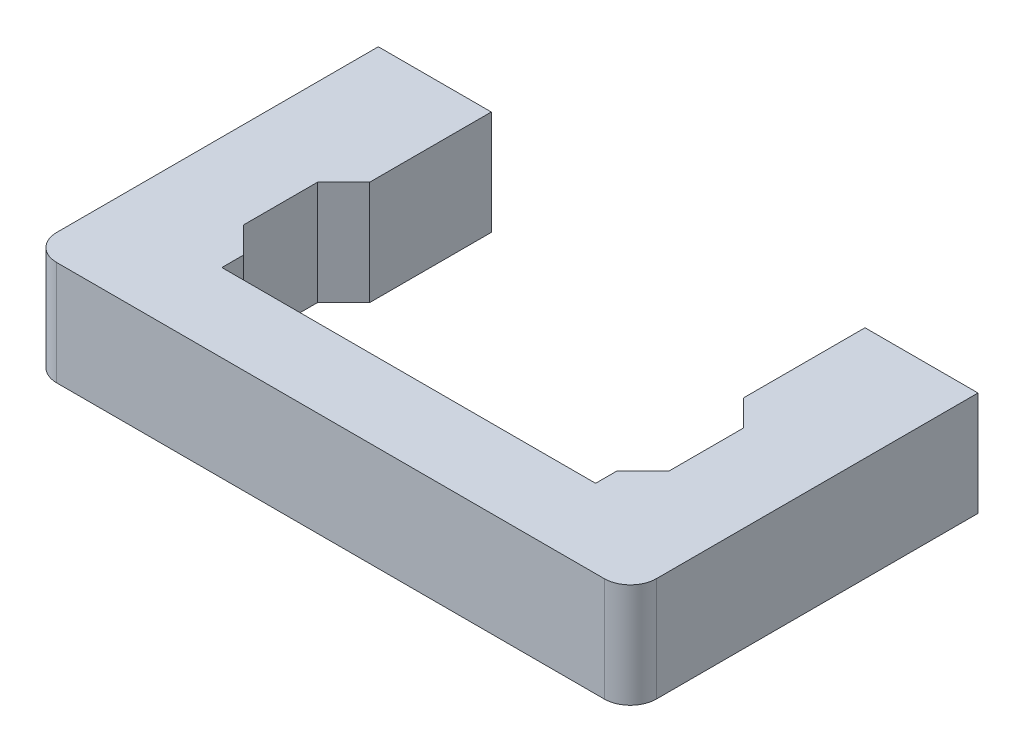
ISO-10303-21;
HEADER;
FILE_DESCRIPTION(('STEP AP214'),'2;1');
FILE_NAME('part.step','',(''),(''),'','','');
FILE_SCHEMA(('AUTOMOTIVE_DESIGN { 1 0 10303 214 1 1 1 1 }'));
ENDSEC;
DATA;
#1=APPLICATION_CONTEXT('core data for automotive mechanical design processes');
#2=APPLICATION_PROTOCOL_DEFINITION('international standard','automotive_design',2000,#1);
#3=PRODUCT_CONTEXT('',#1,'mechanical');
#4=PRODUCT('Part','Part','',(#3));
#5=PRODUCT_RELATED_PRODUCT_CATEGORY('part','',(#4));
#6=PRODUCT_DEFINITION_FORMATION('','',#4);
#7=PRODUCT_DEFINITION_CONTEXT('part definition',#1,'design');
#8=PRODUCT_DEFINITION('design','',#6,#7);
#9=PRODUCT_DEFINITION_SHAPE('','',#8);
#10=(LENGTH_UNIT() NAMED_UNIT(*) SI_UNIT(.MILLI.,.METRE.));
#11=(NAMED_UNIT(*) PLANE_ANGLE_UNIT() SI_UNIT($,.RADIAN.));
#12=(NAMED_UNIT(*) SI_UNIT($,.STERADIAN.) SOLID_ANGLE_UNIT());
#13=UNCERTAINTY_MEASURE_WITH_UNIT(LENGTH_MEASURE(1.E-05),#10,'distance_accuracy_value','');
#14=(GEOMETRIC_REPRESENTATION_CONTEXT(3) GLOBAL_UNCERTAINTY_ASSIGNED_CONTEXT((#13)) GLOBAL_UNIT_ASSIGNED_CONTEXT((#10,
#11,#12)) REPRESENTATION_CONTEXT('',''));
#15=CARTESIAN_POINT('',(0.,0.,0.));
#16=DIRECTION('',(0.,0.,1.));
#17=DIRECTION('',(1.,0.,0.));
#18=AXIS2_PLACEMENT_3D('',#15,#16,#17);
#19=CARTESIAN_POINT('',(27.5,-6.,40.));
#20=DIRECTION('',(0.,0.,-1.));
#21=DIRECTION('',(0.,1.,0.));
#22=AXIS2_PLACEMENT_3D('',#19,#20,#21);
#23=PLANE('',#22);
#24=DIRECTION('',(0.,1.,0.));
#25=VECTOR('',#24,1.);
#26=CARTESIAN_POINT('',(-4.,-6.,40.));
#27=LINE('',#26,#25);
#28=CARTESIAN_POINT('',(-4.,-6.,40.));
#29=VERTEX_POINT('',#28);
#30=CARTESIAN_POINT('',(-4.,6.,40.));
#31=VERTEX_POINT('',#30);
#32=EDGE_CURVE('E9',#29,#31,#27,.T.);
#33=ORIENTED_EDGE('',*,*,#32,.F.);
#34=DIRECTION('',(-1.,0.,0.));
#35=VECTOR('',#34,1.);
#36=CARTESIAN_POINT('',(27.5,-6.,40.));
#37=LINE('',#36,#35);
#38=CARTESIAN_POINT('',(59.,-6.,40.));
#39=VERTEX_POINT('',#38);
#40=EDGE_CURVE('E157',#39,#29,#37,.T.);
#41=ORIENTED_EDGE('',*,*,#40,.F.);
#42=DIRECTION('',(0.,1.,0.));
#43=VECTOR('',#42,1.);
#44=CARTESIAN_POINT('',(59.,-6.,40.));
#45=LINE('',#44,#43);
#46=CARTESIAN_POINT('',(59.,6.,40.));
#47=VERTEX_POINT('',#46);
#48=EDGE_CURVE('E155',#39,#47,#45,.T.);
#49=ORIENTED_EDGE('',*,*,#48,.T.);
#50=DIRECTION('',(-1.,0.,0.));
#51=VECTOR('',#50,1.);
#52=CARTESIAN_POINT('',(27.5,6.,40.));
#53=LINE('',#52,#51);
#54=EDGE_CURVE('E141',#47,#31,#53,.T.);
#55=ORIENTED_EDGE('',*,*,#54,.T.);
#56=EDGE_LOOP('',(#33,#41,#49,#55));
#57=FACE_BOUND('',#56,.T.);
#58=ADVANCED_FACE('F14',(#57),#23,.F.);
#59=CARTESIAN_POINT('',(-4.,-6.,37.));
#60=DIRECTION('',(0.,1.,0.));
#61=DIRECTION('',(-1.,0.,0.));
#62=AXIS2_PLACEMENT_3D('',#59,#60,#61);
#63=CYLINDRICAL_SURFACE('',#62,3.);
#64=DIRECTION('',(0.,1.,0.));
#65=VECTOR('',#64,1.);
#66=CARTESIAN_POINT('',(-7.,-6.,37.));
#67=LINE('',#66,#65);
#68=CARTESIAN_POINT('',(-7.,-6.,37.));
#69=VERTEX_POINT('',#68);
#70=CARTESIAN_POINT('',(-7.,6.,37.));
#71=VERTEX_POINT('',#70);
#72=EDGE_CURVE('E22',#69,#71,#67,.T.);
#73=ORIENTED_EDGE('',*,*,#72,.F.);
#74=CARTESIAN_POINT('',(-4.,-6.,37.));
#75=DIRECTION('',(0.,-1.,0.));
#76=DIRECTION('',(1.,0.,0.));
#77=AXIS2_PLACEMENT_3D('',#74,#75,#76);
#78=CIRCLE('',#77,3.);
#79=EDGE_CURVE('E260',#29,#69,#78,.T.);
#80=ORIENTED_EDGE('',*,*,#79,.F.);
#81=ORIENTED_EDGE('',*,*,#32,.T.);
#82=CARTESIAN_POINT('',(-4.,6.,37.));
#83=DIRECTION('',(0.,-1.,0.));
#84=DIRECTION('',(1.,0.,0.));
#85=AXIS2_PLACEMENT_3D('',#82,#83,#84);
#86=CIRCLE('',#85,3.);
#87=EDGE_CURVE('E150',#31,#71,#86,.T.);
#88=ORIENTED_EDGE('',*,*,#87,.T.);
#89=EDGE_LOOP('',(#73,#80,#81,#88));
#90=FACE_BOUND('',#89,.T.);
#91=ADVANCED_FACE('F16',(#90),#63,.T.);
#92=CARTESIAN_POINT('',(-7.,-6.,37.));
#93=DIRECTION('',(1.,0.,0.));
#94=DIRECTION('',(0.,1.,0.));
#95=AXIS2_PLACEMENT_3D('',#92,#93,#94);
#96=PLANE('',#95);
#97=DIRECTION('',(0.,1.,0.));
#98=VECTOR('',#97,1.);
#99=CARTESIAN_POINT('',(-7.,-6.,0.));
#100=LINE('',#99,#98);
#101=CARTESIAN_POINT('',(-7.,-6.,0.));
#102=VERTEX_POINT('',#101);
#103=CARTESIAN_POINT('',(-7.,6.,0.));
#104=VERTEX_POINT('',#103);
#105=EDGE_CURVE('E295',#102,#104,#100,.T.);
#106=ORIENTED_EDGE('',*,*,#105,.F.);
#107=DIRECTION('',(0.,0.,-1.));
#108=VECTOR('',#107,1.);
#109=CARTESIAN_POINT('',(-7.,-6.,37.));
#110=LINE('',#109,#108);
#111=EDGE_CURVE('E263',#69,#102,#110,.T.);
#112=ORIENTED_EDGE('',*,*,#111,.F.);
#113=ORIENTED_EDGE('',*,*,#72,.T.);
#114=DIRECTION('',(0.,0.,-1.));
#115=VECTOR('',#114,1.);
#116=CARTESIAN_POINT('',(-7.,6.,37.));
#117=LINE('',#116,#115);
#118=EDGE_CURVE('E236',#71,#104,#117,.T.);
#119=ORIENTED_EDGE('',*,*,#118,.T.);
#120=EDGE_LOOP('',(#106,#112,#113,#119));
#121=FACE_BOUND('',#120,.T.);
#122=ADVANCED_FACE('F298',(#121),#96,.F.);
#123=CARTESIAN_POINT('',(-7.,-6.,0.));
#124=DIRECTION('',(0.,0.,1.));
#125=DIRECTION('',(0.,-1.,0.));
#126=AXIS2_PLACEMENT_3D('',#123,#124,#125);
#127=PLANE('',#126);
#128=CARTESIAN_POINT('',(0.,0.,0.));
#129=DIRECTION('',(0.,0.,-1.));
#130=DIRECTION('',(0.,1.,0.));
#131=AXIS2_PLACEMENT_3D('',#128,#129,#130);
#132=CIRCLE('',#131,2.5);
#133=CARTESIAN_POINT('',(0.,2.5,0.));
#134=VERTEX_POINT('',#133);
#135=EDGE_CURVE('E161',#134,#134,#132,.T.);
#136=ORIENTED_EDGE('',*,*,#135,.F.);
#137=EDGE_LOOP('',(#136));
#138=FACE_BOUND('',#137,.T.);
#139=DIRECTION('',(0.,1.,0.));
#140=VECTOR('',#139,1.);
#141=CARTESIAN_POINT('',(6.,-6.,0.));
#142=LINE('',#141,#140);
#143=CARTESIAN_POINT('',(6.,-6.,0.));
#144=VERTEX_POINT('',#143);
#145=CARTESIAN_POINT('',(6.,6.,0.));
#146=VERTEX_POINT('',#145);
#147=EDGE_CURVE('E293',#144,#146,#142,.T.);
#148=ORIENTED_EDGE('',*,*,#147,.F.);
#149=DIRECTION('',(1.,0.,0.));
#150=VECTOR('',#149,1.);
#151=CARTESIAN_POINT('',(-7.,-6.,0.));
#152=LINE('',#151,#150);
#153=EDGE_CURVE('E266',#102,#144,#152,.T.);
#154=ORIENTED_EDGE('',*,*,#153,.F.);
#155=ORIENTED_EDGE('',*,*,#105,.T.);
#156=DIRECTION('',(1.,0.,0.));
#157=VECTOR('',#156,1.);
#158=CARTESIAN_POINT('',(-7.,6.,0.));
#159=LINE('',#158,#157);
#160=EDGE_CURVE('E239',#104,#146,#159,.T.);
#161=ORIENTED_EDGE('',*,*,#160,.T.);
#162=EDGE_LOOP('',(#148,#154,#155,#161));
#163=FACE_BOUND('',#162,.T.);
#164=ADVANCED_FACE('F305',(#138,#163),#127,.F.);
#165=CARTESIAN_POINT('',(6.,-6.,0.));
#166=DIRECTION('',(-1.,0.,0.));
#167=DIRECTION('',(0.,0.,-1.));
#168=AXIS2_PLACEMENT_3D('',#165,#166,#167);
#169=PLANE('',#168);
#170=DIRECTION('',(0.,1.,0.));
#171=VECTOR('',#170,1.);
#172=CARTESIAN_POINT('',(6.,-6.,14.));
#173=LINE('',#172,#171);
#174=CARTESIAN_POINT('',(6.,-6.,14.));
#175=VERTEX_POINT('',#174);
#176=CARTESIAN_POINT('',(6.,6.,14.));
#177=VERTEX_POINT('',#176);
#178=EDGE_CURVE('E291',#175,#177,#173,.T.);
#179=ORIENTED_EDGE('',*,*,#178,.F.);
#180=DIRECTION('',(0.,0.,1.));
#181=VECTOR('',#180,1.);
#182=CARTESIAN_POINT('',(6.,-6.,0.));
#183=LINE('',#182,#181);
#184=EDGE_CURVE('E269',#144,#175,#183,.T.);
#185=ORIENTED_EDGE('',*,*,#184,.F.);
#186=ORIENTED_EDGE('',*,*,#147,.T.);
#187=DIRECTION('',(0.,0.,1.));
#188=VECTOR('',#187,1.);
#189=CARTESIAN_POINT('',(6.,6.,0.));
#190=LINE('',#189,#188);
#191=EDGE_CURVE('E242',#146,#177,#190,.T.);
#192=ORIENTED_EDGE('',*,*,#191,.T.);
#193=EDGE_LOOP('',(#179,#185,#186,#192));
#194=FACE_BOUND('',#193,.T.);
#195=ADVANCED_FACE('F351',(#194),#169,.F.);
#196=CARTESIAN_POINT('',(6.,-6.,14.));
#197=DIRECTION('',(-0.707106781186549,0.,-0.707106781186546));
#198=DIRECTION('',(0.707106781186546,0.,-0.707106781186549));
#199=AXIS2_PLACEMENT_3D('',#196,#197,#198);
#200=PLANE('',#199);
#201=DIRECTION('',(0.,1.,0.));
#202=VECTOR('',#201,1.);
#203=CARTESIAN_POINT('',(3.,-6.,17.));
#204=LINE('',#203,#202);
#205=CARTESIAN_POINT('',(3.,-6.,17.));
#206=VERTEX_POINT('',#205);
#207=CARTESIAN_POINT('',(3.,6.,17.));
#208=VERTEX_POINT('',#207);
#209=EDGE_CURVE('E289',#206,#208,#204,.T.);
#210=ORIENTED_EDGE('',*,*,#209,.F.);
#211=DIRECTION('',(-0.707106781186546,0.,0.707106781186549));
#212=VECTOR('',#211,1.);
#213=CARTESIAN_POINT('',(6.,-6.,14.));
#214=LINE('',#213,#212);
#215=EDGE_CURVE('E272',#175,#206,#214,.T.);
#216=ORIENTED_EDGE('',*,*,#215,.F.);
#217=ORIENTED_EDGE('',*,*,#178,.T.);
#218=DIRECTION('',(-0.707106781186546,0.,0.707106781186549));
#219=VECTOR('',#218,1.);
#220=CARTESIAN_POINT('',(6.,6.,14.));
#221=LINE('',#220,#219);
#222=EDGE_CURVE('E245',#177,#208,#221,.T.);
#223=ORIENTED_EDGE('',*,*,#222,.T.);
#224=EDGE_LOOP('',(#210,#216,#217,#223));
#225=FACE_BOUND('',#224,.T.);
#226=ADVANCED_FACE('F349',(#225),#200,.F.);
#227=CARTESIAN_POINT('',(3.,-6.,25.5));
#228=DIRECTION('',(1.,0.,0.));
#229=DIRECTION('',(0.,0.,1.));
#230=AXIS2_PLACEMENT_3D('',#227,#228,#229);
#231=PLANE('',#230);
#232=DIRECTION('',(0.,1.,0.));
#233=VECTOR('',#232,1.);
#234=CARTESIAN_POINT('',(3.,-6.,25.5));
#235=LINE('',#234,#233);
#236=CARTESIAN_POINT('',(3.,-6.,25.5));
#237=VERTEX_POINT('',#236);
#238=CARTESIAN_POINT('',(3.,6.,25.5));
#239=VERTEX_POINT('',#238);
#240=EDGE_CURVE('E287',#237,#239,#235,.T.);
#241=ORIENTED_EDGE('',*,*,#240,.F.);
#242=DIRECTION('',(0.,0.,-1.));
#243=VECTOR('',#242,1.);
#244=CARTESIAN_POINT('',(3.,-6.,25.5));
#245=LINE('',#244,#243);
#246=EDGE_CURVE('E275',#237,#206,#245,.T.);
#247=ORIENTED_EDGE('',*,*,#246,.T.);
#248=ORIENTED_EDGE('',*,*,#209,.T.);
#249=DIRECTION('',(0.,0.,-1.));
#250=VECTOR('',#249,1.);
#251=CARTESIAN_POINT('',(3.,6.,25.5));
#252=LINE('',#251,#250);
#253=EDGE_CURVE('E248',#239,#208,#252,.T.);
#254=ORIENTED_EDGE('',*,*,#253,.F.);
#255=EDGE_LOOP('',(#241,#247,#248,#254));
#256=FACE_BOUND('',#255,.T.);
#257=ADVANCED_FACE('F345',(#256),#231,.T.);
#258=CARTESIAN_POINT('',(6.,-6.,28.5));
#259=DIRECTION('',(0.707106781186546,0.,-0.707106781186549));
#260=DIRECTION('',(0.707106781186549,0.,0.707106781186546));
#261=AXIS2_PLACEMENT_3D('',#258,#259,#260);
#262=PLANE('',#261);
#263=DIRECTION('',(0.,1.,0.));
#264=VECTOR('',#263,1.);
#265=CARTESIAN_POINT('',(6.,-6.,28.5));
#266=LINE('',#265,#264);
#267=CARTESIAN_POINT('',(6.,-6.,28.5));
#268=VERTEX_POINT('',#267);
#269=CARTESIAN_POINT('',(6.,6.,28.5));
#270=VERTEX_POINT('',#269);
#271=EDGE_CURVE('E37',#268,#270,#266,.T.);
#272=ORIENTED_EDGE('',*,*,#271,.F.);
#273=DIRECTION('',(-0.707106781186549,0.,-0.707106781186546));
#274=VECTOR('',#273,1.);
#275=CARTESIAN_POINT('',(6.,-6.,28.5));
#276=LINE('',#275,#274);
#277=EDGE_CURVE('E278',#268,#237,#276,.T.);
#278=ORIENTED_EDGE('',*,*,#277,.T.);
#279=ORIENTED_EDGE('',*,*,#240,.T.);
#280=DIRECTION('',(-0.707106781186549,0.,-0.707106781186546));
#281=VECTOR('',#280,1.);
#282=CARTESIAN_POINT('',(6.,6.,28.5));
#283=LINE('',#282,#281);
#284=EDGE_CURVE('E251',#270,#239,#283,.T.);
#285=ORIENTED_EDGE('',*,*,#284,.F.);
#286=EDGE_LOOP('',(#272,#278,#279,#285));
#287=FACE_BOUND('',#286,.T.);
#288=ADVANCED_FACE('F342',(#287),#262,.T.);
#289=CARTESIAN_POINT('',(6.,-6.,28.5));
#290=DIRECTION('',(-1.,0.,0.));
#291=DIRECTION('',(0.,0.,-1.));
#292=AXIS2_PLACEMENT_3D('',#289,#290,#291);
#293=PLANE('',#292);
#294=DIRECTION('',(0.,1.,0.));
#295=VECTOR('',#294,1.);
#296=CARTESIAN_POINT('',(6.,-6.,31.));
#297=LINE('',#296,#295);
#298=CARTESIAN_POINT('',(6.,-6.,31.));
#299=VERTEX_POINT('',#298);
#300=CARTESIAN_POINT('',(6.,6.,31.));
#301=VERTEX_POINT('',#300);
#302=EDGE_CURVE('E29',#299,#301,#297,.T.);
#303=ORIENTED_EDGE('',*,*,#302,.F.);
#304=DIRECTION('',(0.,0.,1.));
#305=VECTOR('',#304,1.);
#306=CARTESIAN_POINT('',(6.,-6.,28.5));
#307=LINE('',#306,#305);
#308=EDGE_CURVE('E280',#268,#299,#307,.T.);
#309=ORIENTED_EDGE('',*,*,#308,.F.);
#310=ORIENTED_EDGE('',*,*,#271,.T.);
#311=DIRECTION('',(0.,0.,1.));
#312=VECTOR('',#311,1.);
#313=CARTESIAN_POINT('',(6.,6.,28.5));
#314=LINE('',#313,#312);
#315=EDGE_CURVE('E254',#270,#301,#314,.T.);
#316=ORIENTED_EDGE('',*,*,#315,.T.);
#317=EDGE_LOOP('',(#303,#309,#310,#316));
#318=FACE_BOUND('',#317,.T.);
#319=ADVANCED_FACE('F341',(#318),#293,.F.);
#320=CARTESIAN_POINT('',(27.5,-6.,31.));
#321=DIRECTION('',(0.,0.,-1.));
#322=DIRECTION('',(0.,1.,0.));
#323=AXIS2_PLACEMENT_3D('',#320,#321,#322);
#324=PLANE('',#323);
#325=DIRECTION('',(-1.,0.,0.));
#326=VECTOR('',#325,1.);
#327=CARTESIAN_POINT('',(27.5,6.,31.));
#328=LINE('',#327,#326);
#329=CARTESIAN_POINT('',(49.,6.,31.));
#330=VERTEX_POINT('',#329);
#331=EDGE_CURVE('E256',#330,#301,#328,.T.);
#332=ORIENTED_EDGE('',*,*,#331,.F.);
#333=DIRECTION('',(0.,1.,0.));
#334=VECTOR('',#333,1.);
#335=CARTESIAN_POINT('',(49.,-6.,31.));
#336=LINE('',#335,#334);
#337=CARTESIAN_POINT('',(49.,-6.,31.));
#338=VERTEX_POINT('',#337);
#339=EDGE_CURVE('E215',#338,#330,#336,.T.);
#340=ORIENTED_EDGE('',*,*,#339,.F.);
#341=DIRECTION('',(-1.,0.,0.));
#342=VECTOR('',#341,1.);
#343=CARTESIAN_POINT('',(27.5,-6.,31.));
#344=LINE('',#343,#342);
#345=EDGE_CURVE('E282',#338,#299,#344,.T.);
#346=ORIENTED_EDGE('',*,*,#345,.T.);
#347=ORIENTED_EDGE('',*,*,#302,.T.);
#348=EDGE_LOOP('',(#332,#340,#346,#347));
#349=FACE_BOUND('',#348,.T.);
#350=ADVANCED_FACE('F340',(#349),#324,.T.);
#351=CARTESIAN_POINT('',(-4.,-6.,37.));
#352=DIRECTION('',(0.,-1.,0.));
#353=DIRECTION('',(1.,0.,0.));
#354=AXIS2_PLACEMENT_3D('',#351,#352,#353);
#355=PLANE('',#354);
#356=ORIENTED_EDGE('',*,*,#40,.T.);
#357=ORIENTED_EDGE('',*,*,#79,.T.);
#358=ORIENTED_EDGE('',*,*,#111,.T.);
#359=ORIENTED_EDGE('',*,*,#153,.T.);
#360=ORIENTED_EDGE('',*,*,#184,.T.);
#361=ORIENTED_EDGE('',*,*,#215,.T.);
#362=ORIENTED_EDGE('',*,*,#246,.F.);
#363=ORIENTED_EDGE('',*,*,#277,.F.);
#364=ORIENTED_EDGE('',*,*,#308,.T.);
#365=ORIENTED_EDGE('',*,*,#345,.F.);
#366=DIRECTION('',(0.,0.,1.));
#367=VECTOR('',#366,1.);
#368=CARTESIAN_POINT('',(49.,-6.,28.5));
#369=LINE('',#368,#367);
#370=CARTESIAN_POINT('',(49.,-6.,28.5));
#371=VERTEX_POINT('',#370);
#372=EDGE_CURVE('E212',#371,#338,#369,.T.);
#373=ORIENTED_EDGE('',*,*,#372,.F.);
#374=DIRECTION('',(0.707106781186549,0.,-0.707106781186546));
#375=VECTOR('',#374,1.);
#376=CARTESIAN_POINT('',(49.,-6.,28.5));
#377=LINE('',#376,#375);
#378=CARTESIAN_POINT('',(52.,-6.,25.5));
#379=VERTEX_POINT('',#378);
#380=EDGE_CURVE('E209',#371,#379,#377,.T.);
#381=ORIENTED_EDGE('',*,*,#380,.T.);
#382=DIRECTION('',(0.,0.,-1.));
#383=VECTOR('',#382,1.);
#384=CARTESIAN_POINT('',(52.,-6.,25.5));
#385=LINE('',#384,#383);
#386=CARTESIAN_POINT('',(52.,-6.,17.));
#387=VERTEX_POINT('',#386);
#388=EDGE_CURVE('E206',#379,#387,#385,.T.);
#389=ORIENTED_EDGE('',*,*,#388,.T.);
#390=DIRECTION('',(0.707106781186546,0.,0.707106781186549));
#391=VECTOR('',#390,1.);
#392=CARTESIAN_POINT('',(49.,-6.,14.));
#393=LINE('',#392,#391);
#394=CARTESIAN_POINT('',(49.,-6.,14.));
#395=VERTEX_POINT('',#394);
#396=EDGE_CURVE('E203',#395,#387,#393,.T.);
#397=ORIENTED_EDGE('',*,*,#396,.F.);
#398=DIRECTION('',(0.,0.,1.));
#399=VECTOR('',#398,1.);
#400=CARTESIAN_POINT('',(49.,-6.,0.));
#401=LINE('',#400,#399);
#402=CARTESIAN_POINT('',(49.,-6.,0.));
#403=VERTEX_POINT('',#402);
#404=EDGE_CURVE('E200',#403,#395,#401,.T.);
#405=ORIENTED_EDGE('',*,*,#404,.F.);
#406=DIRECTION('',(-1.,0.,0.));
#407=VECTOR('',#406,1.);
#408=CARTESIAN_POINT('',(62.,-6.,0.));
#409=LINE('',#408,#407);
#410=CARTESIAN_POINT('',(62.,-6.,0.));
#411=VERTEX_POINT('',#410);
#412=EDGE_CURVE('E197',#411,#403,#409,.T.);
#413=ORIENTED_EDGE('',*,*,#412,.F.);
#414=DIRECTION('',(0.,0.,-1.));
#415=VECTOR('',#414,1.);
#416=CARTESIAN_POINT('',(62.,-6.,37.));
#417=LINE('',#416,#415);
#418=CARTESIAN_POINT('',(62.,-6.,37.));
#419=VERTEX_POINT('',#418);
#420=EDGE_CURVE('E194',#419,#411,#417,.T.);
#421=ORIENTED_EDGE('',*,*,#420,.F.);
#422=CARTESIAN_POINT('',(59.,-6.,37.));
#423=DIRECTION('',(0.,1.,0.));
#424=DIRECTION('',(-1.,0.,0.));
#425=AXIS2_PLACEMENT_3D('',#422,#423,#424);
#426=CIRCLE('',#425,3.);
#427=EDGE_CURVE('E192',#39,#419,#426,.T.);
#428=ORIENTED_EDGE('',*,*,#427,.F.);
#429=EDGE_LOOP('',(#356,#357,#358,#359,#360,#361,#362,#363,#364,#365,#373,#381,#389,#397,#405,
#413,#421,#428));
#430=FACE_BOUND('',#429,.T.);
#431=ADVANCED_FACE('F308',(#430),#355,.T.);
#432=CARTESIAN_POINT('',(-4.,6.,37.));
#433=DIRECTION('',(0.,-1.,0.));
#434=DIRECTION('',(1.,0.,0.));
#435=AXIS2_PLACEMENT_3D('',#432,#433,#434);
#436=PLANE('',#435);
#437=ORIENTED_EDGE('',*,*,#54,.F.);
#438=CARTESIAN_POINT('',(59.,6.,37.));
#439=DIRECTION('',(0.,1.,0.));
#440=DIRECTION('',(-1.,0.,0.));
#441=AXIS2_PLACEMENT_3D('',#438,#439,#440);
#442=CIRCLE('',#441,3.);
#443=CARTESIAN_POINT('',(62.,6.,37.));
#444=VERTEX_POINT('',#443);
#445=EDGE_CURVE('E146',#47,#444,#442,.T.);
#446=ORIENTED_EDGE('',*,*,#445,.T.);
#447=DIRECTION('',(0.,0.,-1.));
#448=VECTOR('',#447,1.);
#449=CARTESIAN_POINT('',(62.,6.,37.));
#450=LINE('',#449,#448);
#451=CARTESIAN_POINT('',(62.,6.,0.));
#452=VERTEX_POINT('',#451);
#453=EDGE_CURVE('E165',#444,#452,#450,.T.);
#454=ORIENTED_EDGE('',*,*,#453,.T.);
#455=DIRECTION('',(-1.,0.,0.));
#456=VECTOR('',#455,1.);
#457=CARTESIAN_POINT('',(62.,6.,0.));
#458=LINE('',#457,#456);
#459=CARTESIAN_POINT('',(49.,6.,0.));
#460=VERTEX_POINT('',#459);
#461=EDGE_CURVE('E168',#452,#460,#458,.T.);
#462=ORIENTED_EDGE('',*,*,#461,.T.);
#463=DIRECTION('',(0.,0.,1.));
#464=VECTOR('',#463,1.);
#465=CARTESIAN_POINT('',(49.,6.,0.));
#466=LINE('',#465,#464);
#467=CARTESIAN_POINT('',(49.,6.,14.));
#468=VERTEX_POINT('',#467);
#469=EDGE_CURVE('E177',#460,#468,#466,.T.);
#470=ORIENTED_EDGE('',*,*,#469,.T.);
#471=DIRECTION('',(0.707106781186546,0.,0.707106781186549));
#472=VECTOR('',#471,1.);
#473=CARTESIAN_POINT('',(49.,6.,14.));
#474=LINE('',#473,#472);
#475=CARTESIAN_POINT('',(52.,6.,17.));
#476=VERTEX_POINT('',#475);
#477=EDGE_CURVE('E180',#468,#476,#474,.T.);
#478=ORIENTED_EDGE('',*,*,#477,.T.);
#479=DIRECTION('',(0.,0.,-1.));
#480=VECTOR('',#479,1.);
#481=CARTESIAN_POINT('',(52.,6.,25.5));
#482=LINE('',#481,#480);
#483=CARTESIAN_POINT('',(52.,6.,25.5));
#484=VERTEX_POINT('',#483);
#485=EDGE_CURVE('E183',#484,#476,#482,.T.);
#486=ORIENTED_EDGE('',*,*,#485,.F.);
#487=DIRECTION('',(0.707106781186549,0.,-0.707106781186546));
#488=VECTOR('',#487,1.);
#489=CARTESIAN_POINT('',(49.,6.,28.5));
#490=LINE('',#489,#488);
#491=CARTESIAN_POINT('',(49.,6.,28.5));
#492=VERTEX_POINT('',#491);
#493=EDGE_CURVE('E186',#492,#484,#490,.T.);
#494=ORIENTED_EDGE('',*,*,#493,.F.);
#495=DIRECTION('',(0.,0.,1.));
#496=VECTOR('',#495,1.);
#497=CARTESIAN_POINT('',(49.,6.,28.5));
#498=LINE('',#497,#496);
#499=EDGE_CURVE('E189',#492,#330,#498,.T.);
#500=ORIENTED_EDGE('',*,*,#499,.T.);
#501=ORIENTED_EDGE('',*,*,#331,.T.);
#502=ORIENTED_EDGE('',*,*,#315,.F.);
#503=ORIENTED_EDGE('',*,*,#284,.T.);
#504=ORIENTED_EDGE('',*,*,#253,.T.);
#505=ORIENTED_EDGE('',*,*,#222,.F.);
#506=ORIENTED_EDGE('',*,*,#191,.F.);
#507=ORIENTED_EDGE('',*,*,#160,.F.);
#508=ORIENTED_EDGE('',*,*,#118,.F.);
#509=ORIENTED_EDGE('',*,*,#87,.F.);
#510=EDGE_LOOP('',(#437,#446,#454,#462,#470,#478,#486,#494,#500,#501,#502,#503,#504,#505,#506,
#507,#508,#509));
#511=FACE_BOUND('',#510,.T.);
#512=ADVANCED_FACE('F143',(#511),#436,.F.);
#513=CARTESIAN_POINT('',(0.,0.,10.));
#514=DIRECTION('',(0.,0.,-1.));
#515=DIRECTION('',(0.,1.,0.));
#516=AXIS2_PLACEMENT_3D('',#513,#514,#515);
#517=CYLINDRICAL_SURFACE('',#516,2.5);
#518=CARTESIAN_POINT('',(0.,0.,10.));
#519=DIRECTION('',(0.,0.,-1.));
#520=DIRECTION('',(0.,1.,0.));
#521=AXIS2_PLACEMENT_3D('',#518,#519,#520);
#522=CIRCLE('',#521,2.5);
#523=CARTESIAN_POINT('',(0.,2.5,10.));
#524=VERTEX_POINT('',#523);
#525=EDGE_CURVE('E152',#524,#524,#522,.T.);
#526=ORIENTED_EDGE('',*,*,#525,.F.);
#527=EDGE_LOOP('',(#526));
#528=FACE_BOUND('',#527,.T.);
#529=ORIENTED_EDGE('',*,*,#135,.T.);
#530=EDGE_LOOP('',(#529));
#531=FACE_BOUND('',#530,.T.);
#532=ADVANCED_FACE('F417',(#528,#531),#517,.F.);
#533=CARTESIAN_POINT('',(0.,0.,10.));
#534=DIRECTION('',(0.,0.,-1.));
#535=DIRECTION('',(0.,1.,0.));
#536=AXIS2_PLACEMENT_3D('',#533,#534,#535);
#537=PLANE('',#536);
#538=ORIENTED_EDGE('',*,*,#525,.T.);
#539=EDGE_LOOP('',(#538));
#540=FACE_BOUND('',#539,.T.);
#541=ADVANCED_FACE('F418',(#540),#537,.T.);
#542=CARTESIAN_POINT('',(59.,-6.,37.));
#543=DIRECTION('',(0.,1.,0.));
#544=DIRECTION('',(1.,0.,0.));
#545=AXIS2_PLACEMENT_3D('',#542,#543,#544);
#546=CYLINDRICAL_SURFACE('',#545,3.);
#547=DIRECTION('',(0.,1.,0.));
#548=VECTOR('',#547,1.);
#549=CARTESIAN_POINT('',(62.,-6.,37.));
#550=LINE('',#549,#548);
#551=EDGE_CURVE('E162',#419,#444,#550,.T.);
#552=ORIENTED_EDGE('',*,*,#551,.T.);
#553=ORIENTED_EDGE('',*,*,#445,.F.);
#554=ORIENTED_EDGE('',*,*,#48,.F.);
#555=ORIENTED_EDGE('',*,*,#427,.T.);
#556=EDGE_LOOP('',(#552,#553,#554,#555));
#557=FACE_BOUND('',#556,.T.);
#558=ADVANCED_FACE('F164',(#557),#546,.T.);
#559=CARTESIAN_POINT('',(62.,-6.,37.));
#560=DIRECTION('',(-1.,0.,0.));
#561=DIRECTION('',(0.,1.,0.));
#562=AXIS2_PLACEMENT_3D('',#559,#560,#561);
#563=PLANE('',#562);
#564=DIRECTION('',(0.,1.,0.));
#565=VECTOR('',#564,1.);
#566=CARTESIAN_POINT('',(62.,-6.,0.));
#567=LINE('',#566,#565);
#568=EDGE_CURVE('E228',#411,#452,#567,.T.);
#569=ORIENTED_EDGE('',*,*,#568,.T.);
#570=ORIENTED_EDGE('',*,*,#453,.F.);
#571=ORIENTED_EDGE('',*,*,#551,.F.);
#572=ORIENTED_EDGE('',*,*,#420,.T.);
#573=EDGE_LOOP('',(#569,#570,#571,#572));
#574=FACE_BOUND('',#573,.T.);
#575=ADVANCED_FACE('F314',(#574),#563,.F.);
#576=CARTESIAN_POINT('',(62.,-6.,0.));
#577=DIRECTION('',(0.,0.,1.));
#578=DIRECTION('',(0.,-1.,0.));
#579=AXIS2_PLACEMENT_3D('',#576,#577,#578);
#580=PLANE('',#579);
#581=CARTESIAN_POINT('',(55.,0.,0.));
#582=DIRECTION('',(0.,0.,1.));
#583=DIRECTION('',(0.,1.,0.));
#584=AXIS2_PLACEMENT_3D('',#581,#582,#583);
#585=CIRCLE('',#584,2.5);
#586=CARTESIAN_POINT('',(55.,2.5,0.));
#587=VERTEX_POINT('',#586);
#588=EDGE_CURVE('E171',#587,#587,#585,.T.);
#589=ORIENTED_EDGE('',*,*,#588,.T.);
#590=EDGE_LOOP('',(#589));
#591=FACE_BOUND('',#590,.T.);
#592=DIRECTION('',(0.,1.,0.));
#593=VECTOR('',#592,1.);
#594=CARTESIAN_POINT('',(49.,-6.,0.));
#595=LINE('',#594,#593);
#596=EDGE_CURVE('E226',#403,#460,#595,.T.);
#597=ORIENTED_EDGE('',*,*,#596,.T.);
#598=ORIENTED_EDGE('',*,*,#461,.F.);
#599=ORIENTED_EDGE('',*,*,#568,.F.);
#600=ORIENTED_EDGE('',*,*,#412,.T.);
#601=EDGE_LOOP('',(#597,#598,#599,#600));
#602=FACE_BOUND('',#601,.T.);
#603=ADVANCED_FACE('F318',(#591,#602),#580,.F.);
#604=CARTESIAN_POINT('',(49.,-6.,0.));
#605=DIRECTION('',(1.,0.,0.));
#606=DIRECTION('',(0.,0.,-1.));
#607=AXIS2_PLACEMENT_3D('',#604,#605,#606);
#608=PLANE('',#607);
#609=DIRECTION('',(0.,1.,0.));
#610=VECTOR('',#609,1.);
#611=CARTESIAN_POINT('',(49.,-6.,14.));
#612=LINE('',#611,#610);
#613=EDGE_CURVE('E224',#395,#468,#612,.T.);
#614=ORIENTED_EDGE('',*,*,#613,.T.);
#615=ORIENTED_EDGE('',*,*,#469,.F.);
#616=ORIENTED_EDGE('',*,*,#596,.F.);
#617=ORIENTED_EDGE('',*,*,#404,.T.);
#618=EDGE_LOOP('',(#614,#615,#616,#617));
#619=FACE_BOUND('',#618,.T.);
#620=ADVANCED_FACE('F320',(#619),#608,.F.);
#621=CARTESIAN_POINT('',(49.,-6.,14.));
#622=DIRECTION('',(0.707106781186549,0.,-0.707106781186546));
#623=DIRECTION('',(-0.707106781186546,0.,-0.707106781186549));
#624=AXIS2_PLACEMENT_3D('',#621,#622,#623);
#625=PLANE('',#624);
#626=DIRECTION('',(0.,1.,0.));
#627=VECTOR('',#626,1.);
#628=CARTESIAN_POINT('',(52.,-6.,17.));
#629=LINE('',#628,#627);
#630=EDGE_CURVE('E222',#387,#476,#629,.T.);
#631=ORIENTED_EDGE('',*,*,#630,.T.);
#632=ORIENTED_EDGE('',*,*,#477,.F.);
#633=ORIENTED_EDGE('',*,*,#613,.F.);
#634=ORIENTED_EDGE('',*,*,#396,.T.);
#635=EDGE_LOOP('',(#631,#632,#633,#634));
#636=FACE_BOUND('',#635,.T.);
#637=ADVANCED_FACE('F325',(#636),#625,.F.);
#638=CARTESIAN_POINT('',(52.,-6.,25.5));
#639=DIRECTION('',(-1.,0.,0.));
#640=DIRECTION('',(0.,0.,1.));
#641=AXIS2_PLACEMENT_3D('',#638,#639,#640);
#642=PLANE('',#641);
#643=DIRECTION('',(0.,1.,0.));
#644=VECTOR('',#643,1.);
#645=CARTESIAN_POINT('',(52.,-6.,25.5));
#646=LINE('',#645,#644);
#647=EDGE_CURVE('E220',#379,#484,#646,.T.);
#648=ORIENTED_EDGE('',*,*,#647,.T.);
#649=ORIENTED_EDGE('',*,*,#485,.T.);
#650=ORIENTED_EDGE('',*,*,#630,.F.);
#651=ORIENTED_EDGE('',*,*,#388,.F.);
#652=EDGE_LOOP('',(#648,#649,#650,#651));
#653=FACE_BOUND('',#652,.T.);
#654=ADVANCED_FACE('F328',(#653),#642,.T.);
#655=CARTESIAN_POINT('',(49.,-6.,28.5));
#656=DIRECTION('',(-0.707106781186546,0.,-0.707106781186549));
#657=DIRECTION('',(-0.707106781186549,0.,0.707106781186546));
#658=AXIS2_PLACEMENT_3D('',#655,#656,#657);
#659=PLANE('',#658);
#660=DIRECTION('',(0.,1.,0.));
#661=VECTOR('',#660,1.);
#662=CARTESIAN_POINT('',(49.,-6.,28.5));
#663=LINE('',#662,#661);
#664=EDGE_CURVE('E218',#371,#492,#663,.T.);
#665=ORIENTED_EDGE('',*,*,#664,.T.);
#666=ORIENTED_EDGE('',*,*,#493,.T.);
#667=ORIENTED_EDGE('',*,*,#647,.F.);
#668=ORIENTED_EDGE('',*,*,#380,.F.);
#669=EDGE_LOOP('',(#665,#666,#667,#668));
#670=FACE_BOUND('',#669,.T.);
#671=ADVANCED_FACE('F332',(#670),#659,.T.);
#672=CARTESIAN_POINT('',(49.,-6.,28.5));
#673=DIRECTION('',(1.,0.,0.));
#674=DIRECTION('',(0.,0.,-1.));
#675=AXIS2_PLACEMENT_3D('',#672,#673,#674);
#676=PLANE('',#675);
#677=ORIENTED_EDGE('',*,*,#339,.T.);
#678=ORIENTED_EDGE('',*,*,#499,.F.);
#679=ORIENTED_EDGE('',*,*,#664,.F.);
#680=ORIENTED_EDGE('',*,*,#372,.T.);
#681=EDGE_LOOP('',(#677,#678,#679,#680));
#682=FACE_BOUND('',#681,.T.);
#683=ADVANCED_FACE('F336',(#682),#676,.F.);
#684=CARTESIAN_POINT('',(55.,0.,10.));
#685=DIRECTION('',(0.,0.,-1.));
#686=DIRECTION('',(0.,1.,0.));
#687=AXIS2_PLACEMENT_3D('',#684,#685,#686);
#688=CYLINDRICAL_SURFACE('',#687,2.5);
#689=CARTESIAN_POINT('',(55.,0.,10.));
#690=DIRECTION('',(0.,0.,1.));
#691=DIRECTION('',(0.,1.,0.));
#692=AXIS2_PLACEMENT_3D('',#689,#690,#691);
#693=CIRCLE('',#692,2.5);
#694=CARTESIAN_POINT('',(55.,2.5,10.));
#695=VERTEX_POINT('',#694);
#696=EDGE_CURVE('E166',#695,#695,#693,.T.);
#697=ORIENTED_EDGE('',*,*,#696,.T.);
#698=EDGE_LOOP('',(#697));
#699=FACE_BOUND('',#698,.T.);
#700=ORIENTED_EDGE('',*,*,#588,.F.);
#701=EDGE_LOOP('',(#700));
#702=FACE_BOUND('',#701,.T.);
#703=ADVANCED_FACE('F491',(#699,#702),#688,.F.);
#704=CARTESIAN_POINT('',(55.,0.,10.));
#705=DIRECTION('',(0.,0.,-1.));
#706=DIRECTION('',(0.,1.,0.));
#707=AXIS2_PLACEMENT_3D('',#704,#705,#706);
#708=PLANE('',#707);
#709=ORIENTED_EDGE('',*,*,#696,.F.);
#710=EDGE_LOOP('',(#709));
#711=FACE_BOUND('',#710,.T.);
#712=ADVANCED_FACE('F493',(#711),#708,.T.);
#713=CLOSED_SHELL('',(#58,#91,#122,#164,#195,#226,#257,#288,#319,#350,#431,#512,#532,#541,#558,
#575,#603,#620,#637,#654,#671,#683,#703,#712));
#714=MANIFOLD_SOLID_BREP('B1',#713);
#715=ADVANCED_BREP_SHAPE_REPRESENTATION('',(#18,#714),#14);
#716=SHAPE_DEFINITION_REPRESENTATION(#9,#715);
ENDSEC;
END-ISO-10303-21;
